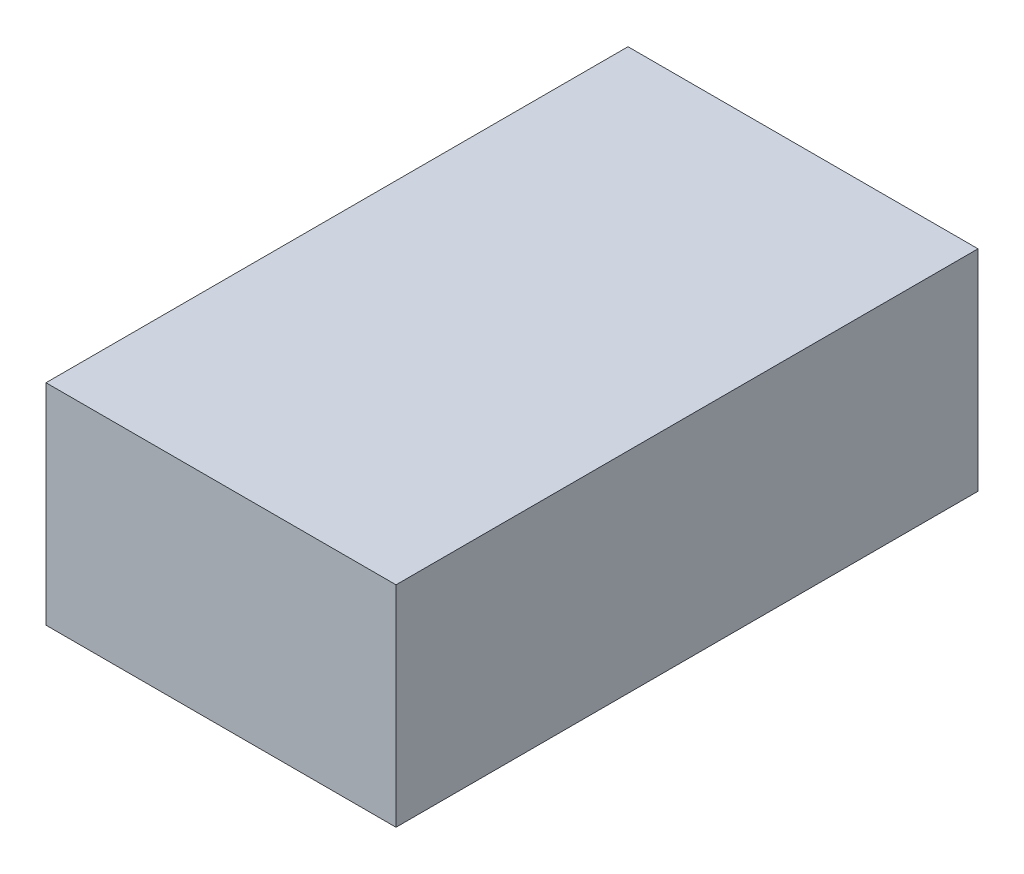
from build123d import *

# Parameters (mm, degrees)
SKETCH1_W            = 38.1
SKETCH1_H            = 105.5878
PANEL_OR_BLOCK_DEPTH = 63.5


with BuildPart() as part:
    # Sketch1 → Panel_or_block (new body)
    with BuildSketch(Plane.YZ):
        with Locations((0, 52.7939)):
            Rectangle(SKETCH1_W, SKETCH1_H)
    extrude(amount=PANEL_OR_BLOCK_DEPTH)


solid = part.part
